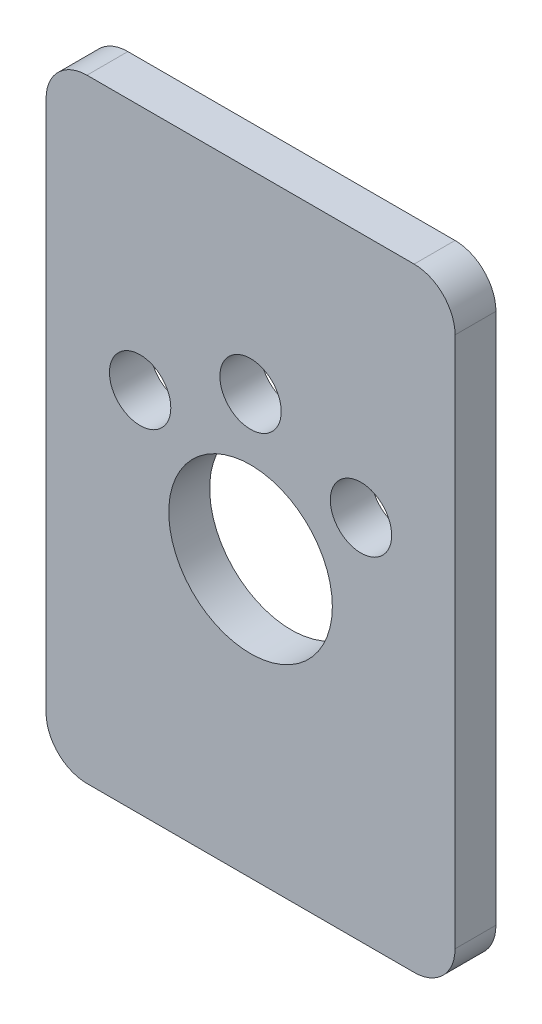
from build123d import *

# Parameters (mm, degrees)
ESQUISSE1_R      = 20
ESQUISSE1_R_2    = 7.5
EXTRUSION1_DEPTH = 10


with BuildPart() as part:
    # Esquisse1 → Extrusion1 (new body)
    with BuildSketch(Plane.XY):
        with BuildLine():
            Line((-50, 65), (-50, -65))
            ThreePointArc((-50, -65), (-47.071067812, -72.071067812), (-40, -75))
            Line((-40, -75), (40, -75))
            ThreePointArc((40, -75), (47.071067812, -72.071067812), (50, -65))
            Line((50, -65), (50, 65))
            ThreePointArc((50, 65), (47.071067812, 72.071067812), (40, 75))
            Line((40, 75), (-40, 75))
            ThreePointArc((-40, 75), (-47.071067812, 72.071067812), (-50, 65))
        make_face()
        with Locations((0, -7.5)):
            Circle(ESQUISSE1_R, mode=Mode.SUBTRACT)
        with Locations((-27, 14.8)):
            Circle(ESQUISSE1_R_2, mode=Mode.SUBTRACT)
        with Locations((0, 27.5)):
            Circle(ESQUISSE1_R_2, mode=Mode.SUBTRACT)
        with Locations((27, 14.8)):
            Circle(ESQUISSE1_R_2, mode=Mode.SUBTRACT)
    extrude(amount=EXTRUSION1_DEPTH)


solid = part.part
